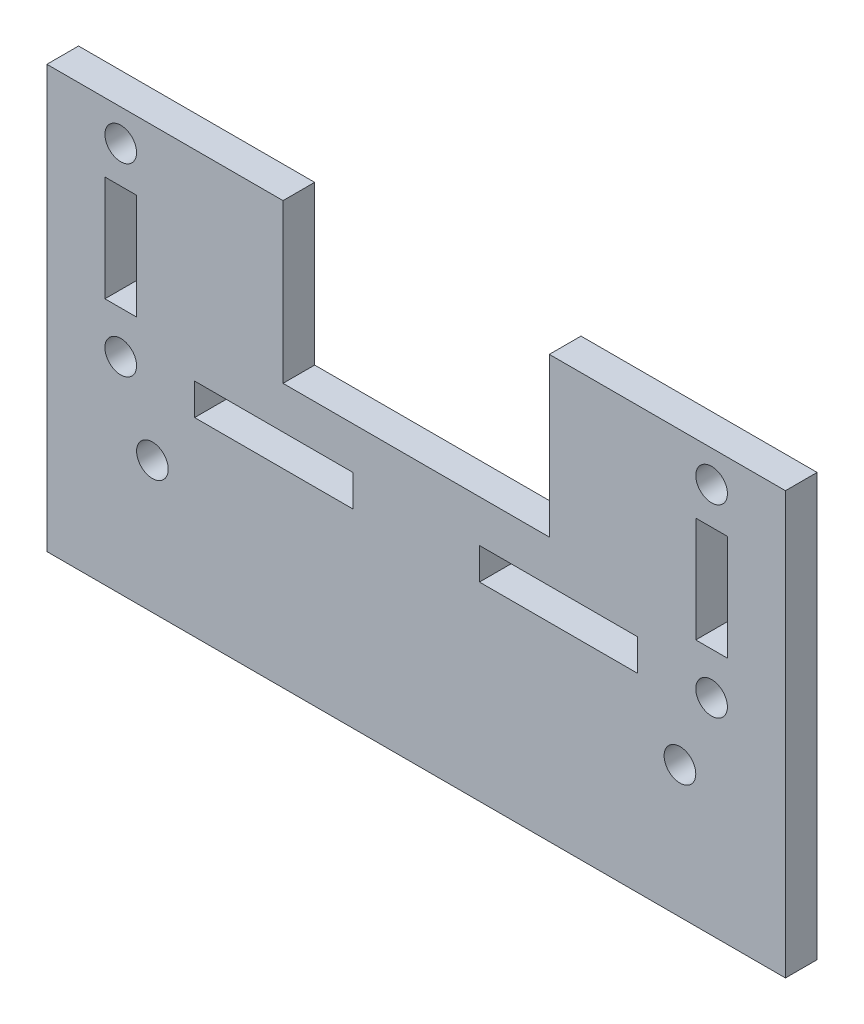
ISO-10303-21;
HEADER;
FILE_DESCRIPTION(('STEP AP214'),'2;1');
FILE_NAME('part.step','',(''),(''),'','','');
FILE_SCHEMA(('AUTOMOTIVE_DESIGN { 1 0 10303 214 1 1 1 1 }'));
ENDSEC;
DATA;
#1=APPLICATION_CONTEXT('core data for automotive mechanical design processes');
#2=APPLICATION_PROTOCOL_DEFINITION('international standard','automotive_design',2000,#1);
#3=PRODUCT_CONTEXT('',#1,'mechanical');
#4=PRODUCT('Part','Part','',(#3));
#5=PRODUCT_RELATED_PRODUCT_CATEGORY('part','',(#4));
#6=PRODUCT_DEFINITION_FORMATION('','',#4);
#7=PRODUCT_DEFINITION_CONTEXT('part definition',#1,'design');
#8=PRODUCT_DEFINITION('design','',#6,#7);
#9=PRODUCT_DEFINITION_SHAPE('','',#8);
#10=(LENGTH_UNIT() NAMED_UNIT(*) SI_UNIT(.MILLI.,.METRE.));
#11=(NAMED_UNIT(*) PLANE_ANGLE_UNIT() SI_UNIT($,.RADIAN.));
#12=(NAMED_UNIT(*) SI_UNIT($,.STERADIAN.) SOLID_ANGLE_UNIT());
#13=UNCERTAINTY_MEASURE_WITH_UNIT(LENGTH_MEASURE(1.E-05),#10,'distance_accuracy_value','');
#14=(GEOMETRIC_REPRESENTATION_CONTEXT(3) GLOBAL_UNCERTAINTY_ASSIGNED_CONTEXT((#13)) GLOBAL_UNIT_ASSIGNED_CONTEXT((#10,
#11,#12)) REPRESENTATION_CONTEXT('',''));
#15=CARTESIAN_POINT('',(0.,0.,0.));
#16=DIRECTION('',(0.,0.,1.));
#17=DIRECTION('',(1.,0.,0.));
#18=AXIS2_PLACEMENT_3D('',#15,#16,#17);
#19=CARTESIAN_POINT('',(0.,0.,3.));
#20=DIRECTION('',(0.,0.,1.));
#21=DIRECTION('',(1.,0.,0.));
#22=AXIS2_PLACEMENT_3D('',#19,#20,#21);
#23=PLANE('',#22);
#24=DIRECTION('',(0.,1.,0.));
#25=VECTOR('',#24,1.);
#26=CARTESIAN_POINT('',(-26.5,-1.83880688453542E-13,3.));
#27=LINE('',#26,#25);
#28=CARTESIAN_POINT('',(-26.5000000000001,11.0000000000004,3.));
#29=VERTEX_POINT('',#28);
#30=CARTESIAN_POINT('',(-26.5000000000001,21.0000000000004,3.));
#31=VERTEX_POINT('',#30);
#32=EDGE_CURVE('E279',#29,#31,#27,.T.);
#33=ORIENTED_EDGE('',*,*,#32,.F.);
#34=DIRECTION('',(-1.,0.,0.));
#35=VECTOR('',#34,1.);
#36=CARTESIAN_POINT('',(0.,11.0000000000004,3.));
#37=LINE('',#36,#35);
#38=CARTESIAN_POINT('',(-29.5000000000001,11.0000000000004,3.));
#39=VERTEX_POINT('',#38);
#40=EDGE_CURVE('E276',#29,#39,#37,.T.);
#41=ORIENTED_EDGE('',*,*,#40,.T.);
#42=DIRECTION('',(0.,1.,0.));
#43=VECTOR('',#42,1.);
#44=CARTESIAN_POINT('',(-29.5,-2.04697370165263E-13,3.));
#45=LINE('',#44,#43);
#46=CARTESIAN_POINT('',(-29.5000000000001,21.0000000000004,3.));
#47=VERTEX_POINT('',#46);
#48=EDGE_CURVE('E285',#39,#47,#45,.T.);
#49=ORIENTED_EDGE('',*,*,#48,.T.);
#50=DIRECTION('',(-1.,0.,0.));
#51=VECTOR('',#50,1.);
#52=CARTESIAN_POINT('',(0.,21.0000000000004,3.));
#53=LINE('',#52,#51);
#54=EDGE_CURVE('E282',#31,#47,#53,.T.);
#55=ORIENTED_EDGE('',*,*,#54,.F.);
#56=EDGE_LOOP('',(#33,#41,#49,#55));
#57=FACE_BOUND('',#56,.T.);
#58=CARTESIAN_POINT('',(-25.,0.,3.));
#59=DIRECTION('',(0.,0.,1.));
#60=DIRECTION('',(1.,0.,0.));
#61=AXIS2_PLACEMENT_3D('',#58,#59,#60);
#62=CIRCLE('',#61,1.5);
#63=CARTESIAN_POINT('',(-23.5,0.,3.));
#64=VERTEX_POINT('',#63);
#65=EDGE_CURVE('E323',#64,#64,#62,.T.);
#66=ORIENTED_EDGE('',*,*,#65,.F.);
#67=EDGE_LOOP('',(#66));
#68=FACE_BOUND('',#67,.T.);
#69=CARTESIAN_POINT('',(25.,0.,3.));
#70=DIRECTION('',(0.,0.,1.));
#71=DIRECTION('',(1.,0.,0.));
#72=AXIS2_PLACEMENT_3D('',#69,#70,#71);
#73=CIRCLE('',#72,1.5);
#74=CARTESIAN_POINT('',(26.5,0.,3.));
#75=VERTEX_POINT('',#74);
#76=EDGE_CURVE('E320',#75,#75,#73,.T.);
#77=ORIENTED_EDGE('',*,*,#76,.F.);
#78=EDGE_LOOP('',(#77));
#79=FACE_BOUND('',#78,.T.);
#80=DIRECTION('',(0.,1.,0.));
#81=VECTOR('',#80,1.);
#82=CARTESIAN_POINT('',(-35.,0.,3.));
#83=LINE('',#82,#81);
#84=CARTESIAN_POINT('',(-35.,-12.5,3.));
#85=VERTEX_POINT('',#84);
#86=CARTESIAN_POINT('',(-35.,27.5,3.));
#87=VERTEX_POINT('',#86);
#88=EDGE_CURVE('E298',#85,#87,#83,.T.);
#89=ORIENTED_EDGE('',*,*,#88,.F.);
#90=DIRECTION('',(1.,0.,0.));
#91=VECTOR('',#90,1.);
#92=CARTESIAN_POINT('',(0.,-12.5,3.));
#93=LINE('',#92,#91);
#94=CARTESIAN_POINT('',(35.,-12.5,3.));
#95=VERTEX_POINT('',#94);
#96=EDGE_CURVE('E301',#85,#95,#93,.T.);
#97=ORIENTED_EDGE('',*,*,#96,.T.);
#98=DIRECTION('',(0.,1.,0.));
#99=VECTOR('',#98,1.);
#100=CARTESIAN_POINT('',(35.,0.,3.));
#101=LINE('',#100,#99);
#102=CARTESIAN_POINT('',(35.,27.5,3.));
#103=VERTEX_POINT('',#102);
#104=EDGE_CURVE('E304',#95,#103,#101,.T.);
#105=ORIENTED_EDGE('',*,*,#104,.T.);
#106=DIRECTION('',(1.,0.,0.));
#107=VECTOR('',#106,1.);
#108=CARTESIAN_POINT('',(0.,27.5,3.));
#109=LINE('',#108,#107);
#110=CARTESIAN_POINT('',(12.6203854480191,27.5,3.));
#111=VERTEX_POINT('',#110);
#112=EDGE_CURVE('E306',#111,#103,#109,.T.);
#113=ORIENTED_EDGE('',*,*,#112,.F.);
#114=DIRECTION('',(0.,1.,0.));
#115=VECTOR('',#114,1.);
#116=CARTESIAN_POINT('',(12.6203854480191,0.,3.));
#117=LINE('',#116,#115);
#118=CARTESIAN_POINT('',(12.6203854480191,12.5,3.));
#119=VERTEX_POINT('',#118);
#120=EDGE_CURVE('E309',#119,#111,#117,.T.);
#121=ORIENTED_EDGE('',*,*,#120,.F.);
#122=DIRECTION('',(1.,0.,0.));
#123=VECTOR('',#122,1.);
#124=CARTESIAN_POINT('',(0.,12.5,3.));
#125=LINE('',#124,#123);
#126=CARTESIAN_POINT('',(-12.6203854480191,12.5,3.));
#127=VERTEX_POINT('',#126);
#128=EDGE_CURVE('E312',#127,#119,#125,.T.);
#129=ORIENTED_EDGE('',*,*,#128,.F.);
#130=DIRECTION('',(0.,1.,0.));
#131=VECTOR('',#130,1.);
#132=CARTESIAN_POINT('',(-12.6203854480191,0.,3.));
#133=LINE('',#132,#131);
#134=CARTESIAN_POINT('',(-12.6203854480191,27.5,3.));
#135=VERTEX_POINT('',#134);
#136=EDGE_CURVE('E315',#127,#135,#133,.T.);
#137=ORIENTED_EDGE('',*,*,#136,.T.);
#138=DIRECTION('',(1.,0.,0.));
#139=VECTOR('',#138,1.);
#140=CARTESIAN_POINT('',(0.,27.5,3.));
#141=LINE('',#140,#139);
#142=EDGE_CURVE('E317',#87,#135,#141,.T.);
#143=ORIENTED_EDGE('',*,*,#142,.F.);
#144=EDGE_LOOP('',(#89,#97,#105,#113,#121,#129,#137,#143));
#145=FACE_BOUND('',#144,.T.);
#146=DIRECTION('',(1.,0.,0.));
#147=VECTOR('',#146,1.);
#148=CARTESIAN_POINT('',(0.,5.50000000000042,3.));
#149=LINE('',#148,#147);
#150=CARTESIAN_POINT('',(6.,5.50000000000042,3.));
#151=VERTEX_POINT('',#150);
#152=CARTESIAN_POINT('',(21.,5.50000000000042,3.));
#153=VERTEX_POINT('',#152);
#154=EDGE_CURVE('E209',#151,#153,#149,.T.);
#155=ORIENTED_EDGE('',*,*,#154,.F.);
#156=DIRECTION('',(0.,1.,0.));
#157=VECTOR('',#156,1.);
#158=CARTESIAN_POINT('',(6.,0.,3.));
#159=LINE('',#158,#157);
#160=CARTESIAN_POINT('',(6.,8.50000000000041,3.));
#161=VERTEX_POINT('',#160);
#162=EDGE_CURVE('E243',#151,#161,#159,.T.);
#163=ORIENTED_EDGE('',*,*,#162,.T.);
#164=DIRECTION('',(1.,0.,0.));
#165=VECTOR('',#164,1.);
#166=CARTESIAN_POINT('',(0.,8.50000000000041,3.));
#167=LINE('',#166,#165);
#168=CARTESIAN_POINT('',(21.,8.50000000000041,3.));
#169=VERTEX_POINT('',#168);
#170=EDGE_CURVE('E252',#161,#169,#167,.T.);
#171=ORIENTED_EDGE('',*,*,#170,.T.);
#172=DIRECTION('',(0.,1.,0.));
#173=VECTOR('',#172,1.);
#174=CARTESIAN_POINT('',(21.,0.,3.));
#175=LINE('',#174,#173);
#176=EDGE_CURVE('E255',#153,#169,#175,.T.);
#177=ORIENTED_EDGE('',*,*,#176,.F.);
#178=EDGE_LOOP('',(#155,#163,#171,#177));
#179=FACE_BOUND('',#178,.T.);
#180=DIRECTION('',(1.,0.,0.));
#181=VECTOR('',#180,1.);
#182=CARTESIAN_POINT('',(0.,11.0000000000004,3.));
#183=LINE('',#182,#181);
#184=CARTESIAN_POINT('',(26.5,11.0000000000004,3.));
#185=VERTEX_POINT('',#184);
#186=CARTESIAN_POINT('',(29.5,11.0000000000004,3.));
#187=VERTEX_POINT('',#186);
#188=EDGE_CURVE('E65',#185,#187,#183,.T.);
#189=ORIENTED_EDGE('',*,*,#188,.F.);
#190=DIRECTION('',(0.,1.,0.));
#191=VECTOR('',#190,1.);
#192=CARTESIAN_POINT('',(26.5,0.,3.));
#193=LINE('',#192,#191);
#194=CARTESIAN_POINT('',(26.5,21.0000000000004,3.));
#195=VERTEX_POINT('',#194);
#196=EDGE_CURVE('E261',#185,#195,#193,.T.);
#197=ORIENTED_EDGE('',*,*,#196,.T.);
#198=DIRECTION('',(1.,0.,0.));
#199=VECTOR('',#198,1.);
#200=CARTESIAN_POINT('',(0.,21.0000000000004,3.));
#201=LINE('',#200,#199);
#202=CARTESIAN_POINT('',(29.5,21.0000000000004,3.));
#203=VERTEX_POINT('',#202);
#204=EDGE_CURVE('E269',#195,#203,#201,.T.);
#205=ORIENTED_EDGE('',*,*,#204,.T.);
#206=DIRECTION('',(0.,1.,0.));
#207=VECTOR('',#206,1.);
#208=CARTESIAN_POINT('',(29.5,0.,3.));
#209=LINE('',#208,#207);
#210=EDGE_CURVE('E272',#187,#203,#209,.T.);
#211=ORIENTED_EDGE('',*,*,#210,.F.);
#212=EDGE_LOOP('',(#189,#197,#205,#211));
#213=FACE_BOUND('',#212,.T.);
#214=CARTESIAN_POINT('',(28.,24.5000000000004,3.));
#215=DIRECTION('',(0.,0.,1.));
#216=DIRECTION('',(1.,0.,0.));
#217=AXIS2_PLACEMENT_3D('',#214,#215,#216);
#218=CIRCLE('',#217,1.5);
#219=CARTESIAN_POINT('',(29.5,24.5000000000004,3.));
#220=VERTEX_POINT('',#219);
#221=EDGE_CURVE('E233',#220,#220,#218,.T.);
#222=ORIENTED_EDGE('',*,*,#221,.F.);
#223=EDGE_LOOP('',(#222));
#224=FACE_BOUND('',#223,.T.);
#225=CARTESIAN_POINT('',(28.,7.00000000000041,3.));
#226=DIRECTION('',(0.,0.,1.));
#227=DIRECTION('',(1.,0.,0.));
#228=AXIS2_PLACEMENT_3D('',#225,#226,#227);
#229=CIRCLE('',#228,1.5);
#230=CARTESIAN_POINT('',(29.5,7.00000000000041,3.));
#231=VERTEX_POINT('',#230);
#232=EDGE_CURVE('E237',#231,#231,#229,.T.);
#233=ORIENTED_EDGE('',*,*,#232,.F.);
#234=EDGE_LOOP('',(#233));
#235=FACE_BOUND('',#234,.T.);
#236=DIRECTION('',(1.,0.,0.));
#237=VECTOR('',#236,1.);
#238=CARTESIAN_POINT('',(0.,5.50000000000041,3.));
#239=LINE('',#238,#237);
#240=CARTESIAN_POINT('',(-21.,5.50000000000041,3.));
#241=VERTEX_POINT('',#240);
#242=CARTESIAN_POINT('',(-6.,5.50000000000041,3.));
#243=VERTEX_POINT('',#242);
#244=EDGE_CURVE('E57',#241,#243,#239,.T.);
#245=ORIENTED_EDGE('',*,*,#244,.F.);
#246=DIRECTION('',(0.,1.,0.));
#247=VECTOR('',#246,1.);
#248=CARTESIAN_POINT('',(-21.,0.,3.));
#249=LINE('',#248,#247);
#250=CARTESIAN_POINT('',(-21.,8.50000000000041,3.));
#251=VERTEX_POINT('',#250);
#252=EDGE_CURVE('E212',#241,#251,#249,.T.);
#253=ORIENTED_EDGE('',*,*,#252,.T.);
#254=DIRECTION('',(1.,0.,0.));
#255=VECTOR('',#254,1.);
#256=CARTESIAN_POINT('',(0.,8.50000000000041,3.));
#257=LINE('',#256,#255);
#258=CARTESIAN_POINT('',(-6.,8.50000000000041,3.));
#259=VERTEX_POINT('',#258);
#260=EDGE_CURVE('E218',#251,#259,#257,.T.);
#261=ORIENTED_EDGE('',*,*,#260,.T.);
#262=DIRECTION('',(0.,1.,0.));
#263=VECTOR('',#262,1.);
#264=CARTESIAN_POINT('',(-6.,0.,3.));
#265=LINE('',#264,#263);
#266=EDGE_CURVE('E224',#243,#259,#265,.T.);
#267=ORIENTED_EDGE('',*,*,#266,.F.);
#268=EDGE_LOOP('',(#245,#253,#261,#267));
#269=FACE_BOUND('',#268,.T.);
#270=CARTESIAN_POINT('',(-28.,7.00000000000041,3.));
#271=DIRECTION('',(0.,0.,1.));
#272=DIRECTION('',(1.,0.,0.));
#273=AXIS2_PLACEMENT_3D('',#270,#271,#272);
#274=CIRCLE('',#273,1.5);
#275=CARTESIAN_POINT('',(-26.5,7.00000000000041,3.));
#276=VERTEX_POINT('',#275);
#277=EDGE_CURVE('E225',#276,#276,#274,.T.);
#278=ORIENTED_EDGE('',*,*,#277,.F.);
#279=EDGE_LOOP('',(#278));
#280=FACE_BOUND('',#279,.T.);
#281=CARTESIAN_POINT('',(-28.0000000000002,24.5000000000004,3.));
#282=DIRECTION('',(0.,0.,1.));
#283=DIRECTION('',(1.,0.,0.));
#284=AXIS2_PLACEMENT_3D('',#281,#282,#283);
#285=CIRCLE('',#284,1.5);
#286=CARTESIAN_POINT('',(-26.5000000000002,24.5000000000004,3.));
#287=VERTEX_POINT('',#286);
#288=EDGE_CURVE('E228',#287,#287,#285,.F.);
#289=ORIENTED_EDGE('',*,*,#288,.T.);
#290=EDGE_LOOP('',(#289));
#291=FACE_BOUND('',#290,.T.);
#292=ADVANCED_FACE('F40',(#57,#68,#79,#145,#179,#213,#224,#235,#269,#280,#291),#23,.T.);
#293=CARTESIAN_POINT('',(0.,0.,0.));
#294=DIRECTION('',(0.,0.,1.));
#295=DIRECTION('',(1.,0.,0.));
#296=AXIS2_PLACEMENT_3D('',#293,#294,#295);
#297=PLANE('',#296);
#298=CARTESIAN_POINT('',(-28.,7.00000000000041,0.));
#299=DIRECTION('',(0.,0.,1.));
#300=DIRECTION('',(1.,0.,0.));
#301=AXIS2_PLACEMENT_3D('',#298,#299,#300);
#302=CIRCLE('',#301,1.5);
#303=CARTESIAN_POINT('',(-26.5,7.00000000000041,0.));
#304=VERTEX_POINT('',#303);
#305=EDGE_CURVE('E409',#304,#304,#302,.T.);
#306=ORIENTED_EDGE('',*,*,#305,.T.);
#307=EDGE_LOOP('',(#306));
#308=FACE_BOUND('',#307,.T.);
#309=DIRECTION('',(0.,1.,0.));
#310=VECTOR('',#309,1.);
#311=CARTESIAN_POINT('',(-21.,0.,0.));
#312=LINE('',#311,#310);
#313=CARTESIAN_POINT('',(-21.,5.50000000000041,0.));
#314=VERTEX_POINT('',#313);
#315=CARTESIAN_POINT('',(-21.,8.50000000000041,0.));
#316=VERTEX_POINT('',#315);
#317=EDGE_CURVE('E49',#314,#316,#312,.T.);
#318=ORIENTED_EDGE('',*,*,#317,.F.);
#319=DIRECTION('',(1.,0.,0.));
#320=VECTOR('',#319,1.);
#321=CARTESIAN_POINT('',(0.,5.50000000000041,0.));
#322=LINE('',#321,#320);
#323=CARTESIAN_POINT('',(-6.,5.50000000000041,0.));
#324=VERTEX_POINT('',#323);
#325=EDGE_CURVE('E12',#314,#324,#322,.T.);
#326=ORIENTED_EDGE('',*,*,#325,.T.);
#327=DIRECTION('',(0.,1.,0.));
#328=VECTOR('',#327,1.);
#329=CARTESIAN_POINT('',(-6.,0.,0.));
#330=LINE('',#329,#328);
#331=CARTESIAN_POINT('',(-6.,8.50000000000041,0.));
#332=VERTEX_POINT('',#331);
#333=EDGE_CURVE('E402',#324,#332,#330,.T.);
#334=ORIENTED_EDGE('',*,*,#333,.T.);
#335=DIRECTION('',(1.,0.,0.));
#336=VECTOR('',#335,1.);
#337=CARTESIAN_POINT('',(0.,8.50000000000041,0.));
#338=LINE('',#337,#336);
#339=EDGE_CURVE('E412',#316,#332,#338,.T.);
#340=ORIENTED_EDGE('',*,*,#339,.F.);
#341=EDGE_LOOP('',(#318,#326,#334,#340));
#342=FACE_BOUND('',#341,.T.);
#343=CARTESIAN_POINT('',(28.,7.00000000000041,0.));
#344=DIRECTION('',(0.,0.,1.));
#345=DIRECTION('',(1.,0.,0.));
#346=AXIS2_PLACEMENT_3D('',#343,#344,#345);
#347=CIRCLE('',#346,1.5);
#348=CARTESIAN_POINT('',(29.5,7.00000000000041,0.));
#349=VERTEX_POINT('',#348);
#350=EDGE_CURVE('E406',#349,#349,#347,.T.);
#351=ORIENTED_EDGE('',*,*,#350,.T.);
#352=EDGE_LOOP('',(#351));
#353=FACE_BOUND('',#352,.T.);
#354=CARTESIAN_POINT('',(28.,24.5000000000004,0.));
#355=DIRECTION('',(0.,0.,1.));
#356=DIRECTION('',(1.,0.,0.));
#357=AXIS2_PLACEMENT_3D('',#354,#355,#356);
#358=CIRCLE('',#357,1.5);
#359=CARTESIAN_POINT('',(29.5,24.5000000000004,0.));
#360=VERTEX_POINT('',#359);
#361=EDGE_CURVE('E403',#360,#360,#358,.T.);
#362=ORIENTED_EDGE('',*,*,#361,.T.);
#363=EDGE_LOOP('',(#362));
#364=FACE_BOUND('',#363,.T.);
#365=DIRECTION('',(0.,1.,0.));
#366=VECTOR('',#365,1.);
#367=CARTESIAN_POINT('',(26.5,0.,0.));
#368=LINE('',#367,#366);
#369=CARTESIAN_POINT('',(26.5,11.0000000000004,0.));
#370=VERTEX_POINT('',#369);
#371=CARTESIAN_POINT('',(26.5,21.0000000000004,0.));
#372=VERTEX_POINT('',#371);
#373=EDGE_CURVE('E397',#370,#372,#368,.T.);
#374=ORIENTED_EDGE('',*,*,#373,.F.);
#375=DIRECTION('',(1.,0.,0.));
#376=VECTOR('',#375,1.);
#377=CARTESIAN_POINT('',(0.,11.0000000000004,0.));
#378=LINE('',#377,#376);
#379=CARTESIAN_POINT('',(29.5,11.0000000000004,0.));
#380=VERTEX_POINT('',#379);
#381=EDGE_CURVE('E399',#370,#380,#378,.T.);
#382=ORIENTED_EDGE('',*,*,#381,.T.);
#383=DIRECTION('',(0.,1.,0.));
#384=VECTOR('',#383,1.);
#385=CARTESIAN_POINT('',(29.5,0.,0.));
#386=LINE('',#385,#384);
#387=CARTESIAN_POINT('',(29.5,21.0000000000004,0.));
#388=VERTEX_POINT('',#387);
#389=EDGE_CURVE('E391',#380,#388,#386,.T.);
#390=ORIENTED_EDGE('',*,*,#389,.T.);
#391=DIRECTION('',(1.,0.,0.));
#392=VECTOR('',#391,1.);
#393=CARTESIAN_POINT('',(0.,21.0000000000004,0.));
#394=LINE('',#393,#392);
#395=EDGE_CURVE('E394',#372,#388,#394,.T.);
#396=ORIENTED_EDGE('',*,*,#395,.F.);
#397=EDGE_LOOP('',(#374,#382,#390,#396));
#398=FACE_BOUND('',#397,.T.);
#399=DIRECTION('',(0.,1.,0.));
#400=VECTOR('',#399,1.);
#401=CARTESIAN_POINT('',(6.,0.,0.));
#402=LINE('',#401,#400);
#403=CARTESIAN_POINT('',(6.,5.50000000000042,0.));
#404=VERTEX_POINT('',#403);
#405=CARTESIAN_POINT('',(6.,8.50000000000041,0.));
#406=VERTEX_POINT('',#405);
#407=EDGE_CURVE('E386',#404,#406,#402,.T.);
#408=ORIENTED_EDGE('',*,*,#407,.F.);
#409=DIRECTION('',(1.,0.,0.));
#410=VECTOR('',#409,1.);
#411=CARTESIAN_POINT('',(0.,5.50000000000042,0.));
#412=LINE('',#411,#410);
#413=CARTESIAN_POINT('',(21.,5.50000000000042,0.));
#414=VERTEX_POINT('',#413);
#415=EDGE_CURVE('E388',#404,#414,#412,.T.);
#416=ORIENTED_EDGE('',*,*,#415,.T.);
#417=DIRECTION('',(0.,1.,0.));
#418=VECTOR('',#417,1.);
#419=CARTESIAN_POINT('',(21.,0.,0.));
#420=LINE('',#419,#418);
#421=CARTESIAN_POINT('',(21.,8.50000000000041,0.));
#422=VERTEX_POINT('',#421);
#423=EDGE_CURVE('E380',#414,#422,#420,.T.);
#424=ORIENTED_EDGE('',*,*,#423,.T.);
#425=DIRECTION('',(1.,0.,0.));
#426=VECTOR('',#425,1.);
#427=CARTESIAN_POINT('',(0.,8.50000000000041,0.));
#428=LINE('',#427,#426);
#429=EDGE_CURVE('E383',#406,#422,#428,.T.);
#430=ORIENTED_EDGE('',*,*,#429,.F.);
#431=EDGE_LOOP('',(#408,#416,#424,#430));
#432=FACE_BOUND('',#431,.T.);
#433=CARTESIAN_POINT('',(-25.,0.,0.));
#434=DIRECTION('',(0.,0.,1.));
#435=DIRECTION('',(1.,0.,0.));
#436=AXIS2_PLACEMENT_3D('',#433,#434,#435);
#437=CIRCLE('',#436,1.5);
#438=CARTESIAN_POINT('',(-23.5,0.,0.));
#439=VERTEX_POINT('',#438);
#440=EDGE_CURVE('E302',#439,#439,#437,.T.);
#441=ORIENTED_EDGE('',*,*,#440,.T.);
#442=EDGE_LOOP('',(#441));
#443=FACE_BOUND('',#442,.T.);
#444=CARTESIAN_POINT('',(25.,0.,0.));
#445=DIRECTION('',(0.,0.,1.));
#446=DIRECTION('',(1.,0.,0.));
#447=AXIS2_PLACEMENT_3D('',#444,#445,#446);
#448=CIRCLE('',#447,1.5);
#449=CARTESIAN_POINT('',(26.5,0.,0.));
#450=VERTEX_POINT('',#449);
#451=EDGE_CURVE('E349',#450,#450,#448,.T.);
#452=ORIENTED_EDGE('',*,*,#451,.T.);
#453=EDGE_LOOP('',(#452));
#454=FACE_BOUND('',#453,.T.);
#455=DIRECTION('',(0.,1.,0.));
#456=VECTOR('',#455,1.);
#457=CARTESIAN_POINT('',(-35.,0.,0.));
#458=LINE('',#457,#456);
#459=CARTESIAN_POINT('',(-35.,-12.5,0.));
#460=VERTEX_POINT('',#459);
#461=CARTESIAN_POINT('',(-35.,27.5,0.));
#462=VERTEX_POINT('',#461);
#463=EDGE_CURVE('E291',#460,#462,#458,.T.);
#464=ORIENTED_EDGE('',*,*,#463,.T.);
#465=DIRECTION('',(1.,0.,0.));
#466=VECTOR('',#465,1.);
#467=CARTESIAN_POINT('',(0.,27.5,0.));
#468=LINE('',#467,#466);
#469=CARTESIAN_POINT('',(-12.6203854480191,27.5,0.));
#470=VERTEX_POINT('',#469);
#471=EDGE_CURVE('E346',#462,#470,#468,.T.);
#472=ORIENTED_EDGE('',*,*,#471,.T.);
#473=DIRECTION('',(0.,1.,0.));
#474=VECTOR('',#473,1.);
#475=CARTESIAN_POINT('',(-12.6203854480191,0.,0.));
#476=LINE('',#475,#474);
#477=CARTESIAN_POINT('',(-12.6203854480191,12.5,0.));
#478=VERTEX_POINT('',#477);
#479=EDGE_CURVE('E343',#478,#470,#476,.T.);
#480=ORIENTED_EDGE('',*,*,#479,.F.);
#481=DIRECTION('',(1.,0.,0.));
#482=VECTOR('',#481,1.);
#483=CARTESIAN_POINT('',(0.,12.5,0.));
#484=LINE('',#483,#482);
#485=CARTESIAN_POINT('',(12.6203854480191,12.5,0.));
#486=VERTEX_POINT('',#485);
#487=EDGE_CURVE('E340',#478,#486,#484,.T.);
#488=ORIENTED_EDGE('',*,*,#487,.T.);
#489=DIRECTION('',(0.,1.,0.));
#490=VECTOR('',#489,1.);
#491=CARTESIAN_POINT('',(12.6203854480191,0.,0.));
#492=LINE('',#491,#490);
#493=CARTESIAN_POINT('',(12.6203854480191,27.5,0.));
#494=VERTEX_POINT('',#493);
#495=EDGE_CURVE('E337',#486,#494,#492,.T.);
#496=ORIENTED_EDGE('',*,*,#495,.T.);
#497=DIRECTION('',(1.,0.,0.));
#498=VECTOR('',#497,1.);
#499=CARTESIAN_POINT('',(0.,27.5,0.));
#500=LINE('',#499,#498);
#501=CARTESIAN_POINT('',(35.,27.5,0.));
#502=VERTEX_POINT('',#501);
#503=EDGE_CURVE('E334',#494,#502,#500,.T.);
#504=ORIENTED_EDGE('',*,*,#503,.T.);
#505=DIRECTION('',(0.,1.,0.));
#506=VECTOR('',#505,1.);
#507=CARTESIAN_POINT('',(35.,0.,0.));
#508=LINE('',#507,#506);
#509=CARTESIAN_POINT('',(35.,-12.5,0.));
#510=VERTEX_POINT('',#509);
#511=EDGE_CURVE('E331',#510,#502,#508,.T.);
#512=ORIENTED_EDGE('',*,*,#511,.F.);
#513=DIRECTION('',(1.,0.,0.));
#514=VECTOR('',#513,1.);
#515=CARTESIAN_POINT('',(0.,-12.5,0.));
#516=LINE('',#515,#514);
#517=EDGE_CURVE('E329',#460,#510,#516,.T.);
#518=ORIENTED_EDGE('',*,*,#517,.F.);
#519=EDGE_LOOP('',(#464,#472,#480,#488,#496,#504,#512,#518));
#520=FACE_BOUND('',#519,.T.);
#521=DIRECTION('',(-1.,0.,0.));
#522=VECTOR('',#521,1.);
#523=CARTESIAN_POINT('',(0.,11.0000000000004,0.));
#524=LINE('',#523,#522);
#525=CARTESIAN_POINT('',(-26.5000000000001,11.0000000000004,0.));
#526=VERTEX_POINT('',#525);
#527=CARTESIAN_POINT('',(-29.5000000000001,11.0000000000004,0.));
#528=VERTEX_POINT('',#527);
#529=EDGE_CURVE('E378',#526,#528,#524,.T.);
#530=ORIENTED_EDGE('',*,*,#529,.F.);
#531=DIRECTION('',(0.,1.,0.));
#532=VECTOR('',#531,1.);
#533=CARTESIAN_POINT('',(-26.5,-1.83880688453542E-13,0.));
#534=LINE('',#533,#532);
#535=CARTESIAN_POINT('',(-26.5000000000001,21.0000000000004,0.));
#536=VERTEX_POINT('',#535);
#537=EDGE_CURVE('E370',#526,#536,#534,.T.);
#538=ORIENTED_EDGE('',*,*,#537,.T.);
#539=DIRECTION('',(-1.,0.,0.));
#540=VECTOR('',#539,1.);
#541=CARTESIAN_POINT('',(0.,21.0000000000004,0.));
#542=LINE('',#541,#540);
#543=CARTESIAN_POINT('',(-29.5000000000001,21.0000000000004,0.));
#544=VERTEX_POINT('',#543);
#545=EDGE_CURVE('E373',#536,#544,#542,.T.);
#546=ORIENTED_EDGE('',*,*,#545,.T.);
#547=DIRECTION('',(0.,1.,0.));
#548=VECTOR('',#547,1.);
#549=CARTESIAN_POINT('',(-29.5,-2.04697370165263E-13,0.));
#550=LINE('',#549,#548);
#551=EDGE_CURVE('E376',#528,#544,#550,.T.);
#552=ORIENTED_EDGE('',*,*,#551,.F.);
#553=EDGE_LOOP('',(#530,#538,#546,#552));
#554=FACE_BOUND('',#553,.T.);
#555=CARTESIAN_POINT('',(-28.0000000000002,24.5000000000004,0.));
#556=DIRECTION('',(0.,0.,1.));
#557=DIRECTION('',(1.,0.,0.));
#558=AXIS2_PLACEMENT_3D('',#555,#556,#557);
#559=CIRCLE('',#558,1.5);
#560=CARTESIAN_POINT('',(-26.5000000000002,24.5000000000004,0.));
#561=VERTEX_POINT('',#560);
#562=EDGE_CURVE('E44',#561,#561,#559,.F.);
#563=ORIENTED_EDGE('',*,*,#562,.F.);
#564=EDGE_LOOP('',(#563));
#565=FACE_BOUND('',#564,.T.);
#566=ADVANCED_FACE('F423',(#308,#342,#353,#364,#398,#432,#443,#454,#520,#554,#565),#297,.F.);
#567=CARTESIAN_POINT('',(-35.,0.,3.));
#568=DIRECTION('',(-1.,0.,0.));
#569=DIRECTION('',(0.,0.,1.));
#570=AXIS2_PLACEMENT_3D('',#567,#568,#569);
#571=PLANE('',#570);
#572=ORIENTED_EDGE('',*,*,#463,.F.);
#573=DIRECTION('',(0.,0.,-1.));
#574=VECTOR('',#573,1.);
#575=CARTESIAN_POINT('',(-35.,-12.5,3.));
#576=LINE('',#575,#574);
#577=EDGE_CURVE('E368',#85,#460,#576,.T.);
#578=ORIENTED_EDGE('',*,*,#577,.F.);
#579=ORIENTED_EDGE('',*,*,#88,.T.);
#580=DIRECTION('',(0.,0.,-1.));
#581=VECTOR('',#580,1.);
#582=CARTESIAN_POINT('',(-35.,27.5,3.));
#583=LINE('',#582,#581);
#584=EDGE_CURVE('E326',#87,#462,#583,.T.);
#585=ORIENTED_EDGE('',*,*,#584,.T.);
#586=EDGE_LOOP('',(#572,#578,#579,#585));
#587=FACE_BOUND('',#586,.T.);
#588=ADVANCED_FACE('F42',(#587),#571,.T.);
#589=CARTESIAN_POINT('',(0.,-12.5,3.));
#590=DIRECTION('',(0.,1.,0.));
#591=DIRECTION('',(0.,0.,1.));
#592=AXIS2_PLACEMENT_3D('',#589,#590,#591);
#593=PLANE('',#592);
#594=ORIENTED_EDGE('',*,*,#517,.T.);
#595=DIRECTION('',(0.,0.,-1.));
#596=VECTOR('',#595,1.);
#597=CARTESIAN_POINT('',(35.,-12.5,3.));
#598=LINE('',#597,#596);
#599=EDGE_CURVE('E365',#95,#510,#598,.T.);
#600=ORIENTED_EDGE('',*,*,#599,.F.);
#601=ORIENTED_EDGE('',*,*,#96,.F.);
#602=ORIENTED_EDGE('',*,*,#577,.T.);
#603=EDGE_LOOP('',(#594,#600,#601,#602));
#604=FACE_BOUND('',#603,.T.);
#605=ADVANCED_FACE('F430',(#604),#593,.F.);
#606=CARTESIAN_POINT('',(35.,0.,3.));
#607=DIRECTION('',(-1.,0.,0.));
#608=DIRECTION('',(0.,0.,1.));
#609=AXIS2_PLACEMENT_3D('',#606,#607,#608);
#610=PLANE('',#609);
#611=ORIENTED_EDGE('',*,*,#511,.T.);
#612=DIRECTION('',(0.,0.,-1.));
#613=VECTOR('',#612,1.);
#614=CARTESIAN_POINT('',(35.,27.5,3.));
#615=LINE('',#614,#613);
#616=EDGE_CURVE('E363',#103,#502,#615,.T.);
#617=ORIENTED_EDGE('',*,*,#616,.F.);
#618=ORIENTED_EDGE('',*,*,#104,.F.);
#619=ORIENTED_EDGE('',*,*,#599,.T.);
#620=EDGE_LOOP('',(#611,#617,#618,#619));
#621=FACE_BOUND('',#620,.T.);
#622=ADVANCED_FACE('F465',(#621),#610,.F.);
#623=CARTESIAN_POINT('',(0.,27.5,3.));
#624=DIRECTION('',(0.,1.,0.));
#625=DIRECTION('',(0.,0.,1.));
#626=AXIS2_PLACEMENT_3D('',#623,#624,#625);
#627=PLANE('',#626);
#628=ORIENTED_EDGE('',*,*,#503,.F.);
#629=DIRECTION('',(0.,0.,-1.));
#630=VECTOR('',#629,1.);
#631=CARTESIAN_POINT('',(12.6203854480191,27.5,3.));
#632=LINE('',#631,#630);
#633=EDGE_CURVE('E361',#111,#494,#632,.T.);
#634=ORIENTED_EDGE('',*,*,#633,.F.);
#635=ORIENTED_EDGE('',*,*,#112,.T.);
#636=ORIENTED_EDGE('',*,*,#616,.T.);
#637=EDGE_LOOP('',(#628,#634,#635,#636));
#638=FACE_BOUND('',#637,.T.);
#639=ADVANCED_FACE('F461',(#638),#627,.T.);
#640=CARTESIAN_POINT('',(12.6203854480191,0.,3.));
#641=DIRECTION('',(-1.,0.,0.));
#642=DIRECTION('',(0.,0.,1.));
#643=AXIS2_PLACEMENT_3D('',#640,#641,#642);
#644=PLANE('',#643);
#645=ORIENTED_EDGE('',*,*,#495,.F.);
#646=DIRECTION('',(0.,0.,-1.));
#647=VECTOR('',#646,1.);
#648=CARTESIAN_POINT('',(12.6203854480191,12.5,3.));
#649=LINE('',#648,#647);
#650=EDGE_CURVE('E359',#119,#486,#649,.T.);
#651=ORIENTED_EDGE('',*,*,#650,.F.);
#652=ORIENTED_EDGE('',*,*,#120,.T.);
#653=ORIENTED_EDGE('',*,*,#633,.T.);
#654=EDGE_LOOP('',(#645,#651,#652,#653));
#655=FACE_BOUND('',#654,.T.);
#656=ADVANCED_FACE('F457',(#655),#644,.T.);
#657=CARTESIAN_POINT('',(0.,12.5,3.));
#658=DIRECTION('',(0.,1.,0.));
#659=DIRECTION('',(0.,0.,1.));
#660=AXIS2_PLACEMENT_3D('',#657,#658,#659);
#661=PLANE('',#660);
#662=ORIENTED_EDGE('',*,*,#487,.F.);
#663=DIRECTION('',(0.,0.,-1.));
#664=VECTOR('',#663,1.);
#665=CARTESIAN_POINT('',(-12.6203854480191,12.5,3.));
#666=LINE('',#665,#664);
#667=EDGE_CURVE('E357',#127,#478,#666,.T.);
#668=ORIENTED_EDGE('',*,*,#667,.F.);
#669=ORIENTED_EDGE('',*,*,#128,.T.);
#670=ORIENTED_EDGE('',*,*,#650,.T.);
#671=EDGE_LOOP('',(#662,#668,#669,#670));
#672=FACE_BOUND('',#671,.T.);
#673=ADVANCED_FACE('F453',(#672),#661,.T.);
#674=CARTESIAN_POINT('',(-12.6203854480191,0.,3.));
#675=DIRECTION('',(-1.,0.,0.));
#676=DIRECTION('',(0.,0.,1.));
#677=AXIS2_PLACEMENT_3D('',#674,#675,#676);
#678=PLANE('',#677);
#679=ORIENTED_EDGE('',*,*,#479,.T.);
#680=DIRECTION('',(0.,0.,-1.));
#681=VECTOR('',#680,1.);
#682=CARTESIAN_POINT('',(-12.6203854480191,27.5,3.));
#683=LINE('',#682,#681);
#684=EDGE_CURVE('E355',#135,#470,#683,.T.);
#685=ORIENTED_EDGE('',*,*,#684,.F.);
#686=ORIENTED_EDGE('',*,*,#136,.F.);
#687=ORIENTED_EDGE('',*,*,#667,.T.);
#688=EDGE_LOOP('',(#679,#685,#686,#687));
#689=FACE_BOUND('',#688,.T.);
#690=ADVANCED_FACE('F446',(#689),#678,.F.);
#691=CARTESIAN_POINT('',(25.,0.,3.));
#692=DIRECTION('',(0.,0.,-1.));
#693=DIRECTION('',(-1.,0.,0.));
#694=AXIS2_PLACEMENT_3D('',#691,#692,#693);
#695=CYLINDRICAL_SURFACE('',#694,1.5);
#696=ORIENTED_EDGE('',*,*,#76,.T.);
#697=EDGE_LOOP('',(#696));
#698=FACE_BOUND('',#697,.T.);
#699=ORIENTED_EDGE('',*,*,#451,.F.);
#700=EDGE_LOOP('',(#699));
#701=FACE_BOUND('',#700,.T.);
#702=ADVANCED_FACE('F443',(#698,#701),#695,.F.);
#703=CARTESIAN_POINT('',(0.,27.5,3.));
#704=DIRECTION('',(0.,1.,0.));
#705=DIRECTION('',(0.,0.,1.));
#706=AXIS2_PLACEMENT_3D('',#703,#704,#705);
#707=PLANE('',#706);
#708=ORIENTED_EDGE('',*,*,#471,.F.);
#709=ORIENTED_EDGE('',*,*,#584,.F.);
#710=ORIENTED_EDGE('',*,*,#142,.T.);
#711=ORIENTED_EDGE('',*,*,#684,.T.);
#712=EDGE_LOOP('',(#708,#709,#710,#711));
#713=FACE_BOUND('',#712,.T.);
#714=ADVANCED_FACE('F441',(#713),#707,.T.);
#715=CARTESIAN_POINT('',(-25.,0.,3.));
#716=DIRECTION('',(0.,0.,-1.));
#717=DIRECTION('',(-1.,0.,0.));
#718=AXIS2_PLACEMENT_3D('',#715,#716,#717);
#719=CYLINDRICAL_SURFACE('',#718,1.5);
#720=ORIENTED_EDGE('',*,*,#65,.T.);
#721=EDGE_LOOP('',(#720));
#722=FACE_BOUND('',#721,.T.);
#723=ORIENTED_EDGE('',*,*,#440,.F.);
#724=EDGE_LOOP('',(#723));
#725=FACE_BOUND('',#724,.T.);
#726=ADVANCED_FACE('F437',(#722,#725),#719,.F.);
#727=CARTESIAN_POINT('',(0.,11.0000000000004,-7.));
#728=DIRECTION('',(0.,1.,0.));
#729=DIRECTION('',(0.,0.,1.));
#730=AXIS2_PLACEMENT_3D('',#727,#728,#729);
#731=PLANE('',#730);
#732=ORIENTED_EDGE('',*,*,#529,.T.);
#733=DIRECTION('',(0.,0.,1.));
#734=VECTOR('',#733,1.);
#735=CARTESIAN_POINT('',(-29.5000000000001,11.0000000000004,-7.));
#736=LINE('',#735,#734);
#737=EDGE_CURVE('E289',#528,#39,#736,.T.);
#738=ORIENTED_EDGE('',*,*,#737,.T.);
#739=ORIENTED_EDGE('',*,*,#40,.F.);
#740=DIRECTION('',(0.,0.,1.));
#741=VECTOR('',#740,1.);
#742=CARTESIAN_POINT('',(-26.5000000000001,11.0000000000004,-7.));
#743=LINE('',#742,#741);
#744=EDGE_CURVE('E288',#526,#29,#743,.T.);
#745=ORIENTED_EDGE('',*,*,#744,.F.);
#746=EDGE_LOOP('',(#732,#738,#739,#745));
#747=FACE_BOUND('',#746,.T.);
#748=ADVANCED_FACE('F440',(#747),#731,.T.);
#749=CARTESIAN_POINT('',(-29.5,-2.04697370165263E-13,-7.));
#750=DIRECTION('',(1.,0.,0.));
#751=DIRECTION('',(0.,1.,0.));
#752=AXIS2_PLACEMENT_3D('',#749,#750,#751);
#753=PLANE('',#752);
#754=ORIENTED_EDGE('',*,*,#551,.T.);
#755=DIRECTION('',(0.,0.,1.));
#756=VECTOR('',#755,1.);
#757=CARTESIAN_POINT('',(-29.5000000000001,21.0000000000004,-7.));
#758=LINE('',#757,#756);
#759=EDGE_CURVE('E292',#544,#47,#758,.T.);
#760=ORIENTED_EDGE('',*,*,#759,.T.);
#761=ORIENTED_EDGE('',*,*,#48,.F.);
#762=ORIENTED_EDGE('',*,*,#737,.F.);
#763=EDGE_LOOP('',(#754,#760,#761,#762));
#764=FACE_BOUND('',#763,.T.);
#765=ADVANCED_FACE('F571',(#764),#753,.T.);
#766=CARTESIAN_POINT('',(0.,21.0000000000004,-7.));
#767=DIRECTION('',(0.,1.,0.));
#768=DIRECTION('',(0.,0.,1.));
#769=AXIS2_PLACEMENT_3D('',#766,#767,#768);
#770=PLANE('',#769);
#771=DIRECTION('',(0.,0.,1.));
#772=VECTOR('',#771,1.);
#773=CARTESIAN_POINT('',(-26.5000000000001,21.0000000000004,-7.));
#774=LINE('',#773,#772);
#775=EDGE_CURVE('E294',#536,#31,#774,.T.);
#776=ORIENTED_EDGE('',*,*,#775,.T.);
#777=ORIENTED_EDGE('',*,*,#54,.T.);
#778=ORIENTED_EDGE('',*,*,#759,.F.);
#779=ORIENTED_EDGE('',*,*,#545,.F.);
#780=EDGE_LOOP('',(#776,#777,#778,#779));
#781=FACE_BOUND('',#780,.T.);
#782=ADVANCED_FACE('F547',(#781),#770,.F.);
#783=CARTESIAN_POINT('',(-26.5,-1.83880688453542E-13,-7.));
#784=DIRECTION('',(1.,0.,0.));
#785=DIRECTION('',(0.,1.,0.));
#786=AXIS2_PLACEMENT_3D('',#783,#784,#785);
#787=PLANE('',#786);
#788=ORIENTED_EDGE('',*,*,#744,.T.);
#789=ORIENTED_EDGE('',*,*,#32,.T.);
#790=ORIENTED_EDGE('',*,*,#775,.F.);
#791=ORIENTED_EDGE('',*,*,#537,.F.);
#792=EDGE_LOOP('',(#788,#789,#790,#791));
#793=FACE_BOUND('',#792,.T.);
#794=ADVANCED_FACE('F540',(#793),#787,.F.);
#795=CARTESIAN_POINT('',(0.,5.50000000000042,-7.));
#796=DIRECTION('',(0.,-1.,0.));
#797=DIRECTION('',(0.,0.,-1.));
#798=AXIS2_PLACEMENT_3D('',#795,#796,#797);
#799=PLANE('',#798);
#800=DIRECTION('',(0.,0.,1.));
#801=VECTOR('',#800,1.);
#802=CARTESIAN_POINT('',(6.,5.50000000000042,-7.));
#803=LINE('',#802,#801);
#804=EDGE_CURVE('E248',#404,#151,#803,.T.);
#805=ORIENTED_EDGE('',*,*,#804,.T.);
#806=ORIENTED_EDGE('',*,*,#154,.T.);
#807=DIRECTION('',(0.,0.,1.));
#808=VECTOR('',#807,1.);
#809=CARTESIAN_POINT('',(21.,5.50000000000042,-7.));
#810=LINE('',#809,#808);
#811=EDGE_CURVE('E240',#414,#153,#810,.T.);
#812=ORIENTED_EDGE('',*,*,#811,.F.);
#813=ORIENTED_EDGE('',*,*,#415,.F.);
#814=EDGE_LOOP('',(#805,#806,#812,#813));
#815=FACE_BOUND('',#814,.T.);
#816=ADVANCED_FACE('F538',(#815),#799,.F.);
#817=CARTESIAN_POINT('',(6.,0.,-7.));
#818=DIRECTION('',(1.,0.,0.));
#819=DIRECTION('',(0.,1.,0.));
#820=AXIS2_PLACEMENT_3D('',#817,#818,#819);
#821=PLANE('',#820);
#822=ORIENTED_EDGE('',*,*,#407,.T.);
#823=DIRECTION('',(0.,0.,1.));
#824=VECTOR('',#823,1.);
#825=CARTESIAN_POINT('',(6.,8.50000000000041,-7.));
#826=LINE('',#825,#824);
#827=EDGE_CURVE('E246',#406,#161,#826,.T.);
#828=ORIENTED_EDGE('',*,*,#827,.T.);
#829=ORIENTED_EDGE('',*,*,#162,.F.);
#830=ORIENTED_EDGE('',*,*,#804,.F.);
#831=EDGE_LOOP('',(#822,#828,#829,#830));
#832=FACE_BOUND('',#831,.T.);
#833=ADVANCED_FACE('F529',(#832),#821,.T.);
#834=CARTESIAN_POINT('',(0.,8.50000000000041,-7.));
#835=DIRECTION('',(0.,-1.,0.));
#836=DIRECTION('',(1.,0.,0.));
#837=AXIS2_PLACEMENT_3D('',#834,#835,#836);
#838=PLANE('',#837);
#839=ORIENTED_EDGE('',*,*,#429,.T.);
#840=DIRECTION('',(0.,0.,1.));
#841=VECTOR('',#840,1.);
#842=CARTESIAN_POINT('',(21.,8.50000000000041,-7.));
#843=LINE('',#842,#841);
#844=EDGE_CURVE('E244',#422,#169,#843,.T.);
#845=ORIENTED_EDGE('',*,*,#844,.T.);
#846=ORIENTED_EDGE('',*,*,#170,.F.);
#847=ORIENTED_EDGE('',*,*,#827,.F.);
#848=EDGE_LOOP('',(#839,#845,#846,#847));
#849=FACE_BOUND('',#848,.T.);
#850=ADVANCED_FACE('F533',(#849),#838,.T.);
#851=CARTESIAN_POINT('',(21.,0.,-7.));
#852=DIRECTION('',(1.,0.,0.));
#853=DIRECTION('',(0.,0.,-1.));
#854=AXIS2_PLACEMENT_3D('',#851,#852,#853);
#855=PLANE('',#854);
#856=ORIENTED_EDGE('',*,*,#811,.T.);
#857=ORIENTED_EDGE('',*,*,#176,.T.);
#858=ORIENTED_EDGE('',*,*,#844,.F.);
#859=ORIENTED_EDGE('',*,*,#423,.F.);
#860=EDGE_LOOP('',(#856,#857,#858,#859));
#861=FACE_BOUND('',#860,.T.);
#862=ADVANCED_FACE('F535',(#861),#855,.F.);
#863=CARTESIAN_POINT('',(0.,11.0000000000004,-7.));
#864=DIRECTION('',(0.,-1.,0.));
#865=DIRECTION('',(0.,0.,-1.));
#866=AXIS2_PLACEMENT_3D('',#863,#864,#865);
#867=PLANE('',#866);
#868=DIRECTION('',(0.,0.,1.));
#869=VECTOR('',#868,1.);
#870=CARTESIAN_POINT('',(26.5,11.0000000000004,-7.));
#871=LINE('',#870,#869);
#872=EDGE_CURVE('E236',#370,#185,#871,.T.);
#873=ORIENTED_EDGE('',*,*,#872,.T.);
#874=ORIENTED_EDGE('',*,*,#188,.T.);
#875=DIRECTION('',(0.,0.,1.));
#876=VECTOR('',#875,1.);
#877=CARTESIAN_POINT('',(29.5,11.0000000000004,-7.));
#878=LINE('',#877,#876);
#879=EDGE_CURVE('E259',#380,#187,#878,.T.);
#880=ORIENTED_EDGE('',*,*,#879,.F.);
#881=ORIENTED_EDGE('',*,*,#381,.F.);
#882=EDGE_LOOP('',(#873,#874,#880,#881));
#883=FACE_BOUND('',#882,.T.);
#884=ADVANCED_FACE('F554',(#883),#867,.F.);
#885=CARTESIAN_POINT('',(26.5,0.,-7.));
#886=DIRECTION('',(1.,0.,0.));
#887=DIRECTION('',(0.,0.,-1.));
#888=AXIS2_PLACEMENT_3D('',#885,#886,#887);
#889=PLANE('',#888);
#890=ORIENTED_EDGE('',*,*,#373,.T.);
#891=DIRECTION('',(0.,0.,1.));
#892=VECTOR('',#891,1.);
#893=CARTESIAN_POINT('',(26.5,21.0000000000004,-7.));
#894=LINE('',#893,#892);
#895=EDGE_CURVE('E264',#372,#195,#894,.T.);
#896=ORIENTED_EDGE('',*,*,#895,.T.);
#897=ORIENTED_EDGE('',*,*,#196,.F.);
#898=ORIENTED_EDGE('',*,*,#872,.F.);
#899=EDGE_LOOP('',(#890,#896,#897,#898));
#900=FACE_BOUND('',#899,.T.);
#901=ADVANCED_FACE('F559',(#900),#889,.T.);
#902=CARTESIAN_POINT('',(0.,21.0000000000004,-7.));
#903=DIRECTION('',(0.,-1.,0.));
#904=DIRECTION('',(0.,0.,-1.));
#905=AXIS2_PLACEMENT_3D('',#902,#903,#904);
#906=PLANE('',#905);
#907=ORIENTED_EDGE('',*,*,#395,.T.);
#908=DIRECTION('',(0.,0.,1.));
#909=VECTOR('',#908,1.);
#910=CARTESIAN_POINT('',(29.5,21.0000000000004,-7.));
#911=LINE('',#910,#909);
#912=EDGE_CURVE('E262',#388,#203,#911,.T.);
#913=ORIENTED_EDGE('',*,*,#912,.T.);
#914=ORIENTED_EDGE('',*,*,#204,.F.);
#915=ORIENTED_EDGE('',*,*,#895,.F.);
#916=EDGE_LOOP('',(#907,#913,#914,#915));
#917=FACE_BOUND('',#916,.T.);
#918=ADVANCED_FACE('F563',(#917),#906,.T.);
#919=CARTESIAN_POINT('',(29.5,0.,-7.));
#920=DIRECTION('',(1.,0.,0.));
#921=DIRECTION('',(0.,0.,-1.));
#922=AXIS2_PLACEMENT_3D('',#919,#920,#921);
#923=PLANE('',#922);
#924=ORIENTED_EDGE('',*,*,#879,.T.);
#925=ORIENTED_EDGE('',*,*,#210,.T.);
#926=ORIENTED_EDGE('',*,*,#912,.F.);
#927=ORIENTED_EDGE('',*,*,#389,.F.);
#928=EDGE_LOOP('',(#924,#925,#926,#927));
#929=FACE_BOUND('',#928,.T.);
#930=ADVANCED_FACE('F560',(#929),#923,.F.);
#931=CARTESIAN_POINT('',(28.,24.5000000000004,-7.));
#932=DIRECTION('',(0.,0.,1.));
#933=DIRECTION('',(1.,0.,0.));
#934=AXIS2_PLACEMENT_3D('',#931,#932,#933);
#935=CYLINDRICAL_SURFACE('',#934,1.5);
#936=ORIENTED_EDGE('',*,*,#221,.T.);
#937=EDGE_LOOP('',(#936));
#938=FACE_BOUND('',#937,.T.);
#939=ORIENTED_EDGE('',*,*,#361,.F.);
#940=EDGE_LOOP('',(#939));
#941=FACE_BOUND('',#940,.T.);
#942=ADVANCED_FACE('F508',(#938,#941),#935,.F.);
#943=CARTESIAN_POINT('',(28.,7.00000000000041,-7.));
#944=DIRECTION('',(0.,0.,1.));
#945=DIRECTION('',(1.,0.,0.));
#946=AXIS2_PLACEMENT_3D('',#943,#944,#945);
#947=CYLINDRICAL_SURFACE('',#946,1.5);
#948=ORIENTED_EDGE('',*,*,#232,.T.);
#949=EDGE_LOOP('',(#948));
#950=FACE_BOUND('',#949,.T.);
#951=ORIENTED_EDGE('',*,*,#350,.F.);
#952=EDGE_LOOP('',(#951));
#953=FACE_BOUND('',#952,.T.);
#954=ADVANCED_FACE('F505',(#950,#953),#947,.F.);
#955=CARTESIAN_POINT('',(0.,5.50000000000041,-7.));
#956=DIRECTION('',(0.,-1.,0.));
#957=DIRECTION('',(0.,0.,-1.));
#958=AXIS2_PLACEMENT_3D('',#955,#956,#957);
#959=PLANE('',#958);
#960=DIRECTION('',(0.,0.,1.));
#961=VECTOR('',#960,1.);
#962=CARTESIAN_POINT('',(-21.,5.50000000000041,-7.));
#963=LINE('',#962,#961);
#964=EDGE_CURVE('E203',#314,#241,#963,.T.);
#965=ORIENTED_EDGE('',*,*,#964,.T.);
#966=ORIENTED_EDGE('',*,*,#244,.T.);
#967=DIRECTION('',(0.,0.,1.));
#968=VECTOR('',#967,1.);
#969=CARTESIAN_POINT('',(-6.,5.50000000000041,-7.));
#970=LINE('',#969,#968);
#971=EDGE_CURVE('E219',#324,#243,#970,.T.);
#972=ORIENTED_EDGE('',*,*,#971,.F.);
#973=ORIENTED_EDGE('',*,*,#325,.F.);
#974=EDGE_LOOP('',(#965,#966,#972,#973));
#975=FACE_BOUND('',#974,.T.);
#976=ADVANCED_FACE('F205',(#975),#959,.F.);
#977=CARTESIAN_POINT('',(-21.,0.,-7.));
#978=DIRECTION('',(1.,0.,0.));
#979=DIRECTION('',(0.,0.,-1.));
#980=AXIS2_PLACEMENT_3D('',#977,#978,#979);
#981=PLANE('',#980);
#982=ORIENTED_EDGE('',*,*,#317,.T.);
#983=DIRECTION('',(0.,0.,1.));
#984=VECTOR('',#983,1.);
#985=CARTESIAN_POINT('',(-21.,8.50000000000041,-7.));
#986=LINE('',#985,#984);
#987=EDGE_CURVE('E208',#316,#251,#986,.T.);
#988=ORIENTED_EDGE('',*,*,#987,.T.);
#989=ORIENTED_EDGE('',*,*,#252,.F.);
#990=ORIENTED_EDGE('',*,*,#964,.F.);
#991=EDGE_LOOP('',(#982,#988,#989,#990));
#992=FACE_BOUND('',#991,.T.);
#993=ADVANCED_FACE('F213',(#992),#981,.T.);
#994=CARTESIAN_POINT('',(0.,8.50000000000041,-7.));
#995=DIRECTION('',(0.,-1.,0.));
#996=DIRECTION('',(1.,0.,0.));
#997=AXIS2_PLACEMENT_3D('',#994,#995,#996);
#998=PLANE('',#997);
#999=ORIENTED_EDGE('',*,*,#339,.T.);
#1000=DIRECTION('',(0.,0.,1.));
#1001=VECTOR('',#1000,1.);
#1002=CARTESIAN_POINT('',(-6.,8.50000000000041,-7.));
#1003=LINE('',#1002,#1001);
#1004=EDGE_CURVE('E734',#332,#259,#1003,.T.);
#1005=ORIENTED_EDGE('',*,*,#1004,.T.);
#1006=ORIENTED_EDGE('',*,*,#260,.F.);
#1007=ORIENTED_EDGE('',*,*,#987,.F.);
#1008=EDGE_LOOP('',(#999,#1005,#1006,#1007));
#1009=FACE_BOUND('',#1008,.T.);
#1010=ADVANCED_FACE('F685',(#1009),#998,.T.);
#1011=CARTESIAN_POINT('',(-6.,0.,-7.));
#1012=DIRECTION('',(1.,0.,0.));
#1013=DIRECTION('',(0.,0.,-1.));
#1014=AXIS2_PLACEMENT_3D('',#1011,#1012,#1013);
#1015=PLANE('',#1014);
#1016=ORIENTED_EDGE('',*,*,#971,.T.);
#1017=ORIENTED_EDGE('',*,*,#266,.T.);
#1018=ORIENTED_EDGE('',*,*,#1004,.F.);
#1019=ORIENTED_EDGE('',*,*,#333,.F.);
#1020=EDGE_LOOP('',(#1016,#1017,#1018,#1019));
#1021=FACE_BOUND('',#1020,.T.);
#1022=ADVANCED_FACE('F694',(#1021),#1015,.F.);
#1023=CARTESIAN_POINT('',(-28.,7.00000000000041,-7.));
#1024=DIRECTION('',(0.,0.,1.));
#1025=DIRECTION('',(1.,0.,0.));
#1026=AXIS2_PLACEMENT_3D('',#1023,#1024,#1025);
#1027=CYLINDRICAL_SURFACE('',#1026,1.5);
#1028=ORIENTED_EDGE('',*,*,#277,.T.);
#1029=EDGE_LOOP('',(#1028));
#1030=FACE_BOUND('',#1029,.T.);
#1031=ORIENTED_EDGE('',*,*,#305,.F.);
#1032=EDGE_LOOP('',(#1031));
#1033=FACE_BOUND('',#1032,.T.);
#1034=ADVANCED_FACE('F704',(#1030,#1033),#1027,.F.);
#1035=CARTESIAN_POINT('',(-28.0000000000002,24.5000000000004,-7.));
#1036=DIRECTION('',(0.,0.,1.));
#1037=DIRECTION('',(1.,0.,0.));
#1038=AXIS2_PLACEMENT_3D('',#1035,#1036,#1037);
#1039=CYLINDRICAL_SURFACE('',#1038,1.5);
#1040=ORIENTED_EDGE('',*,*,#288,.F.);
#1041=EDGE_LOOP('',(#1040));
#1042=FACE_BOUND('',#1041,.T.);
#1043=ORIENTED_EDGE('',*,*,#562,.T.);
#1044=EDGE_LOOP('',(#1043));
#1045=FACE_BOUND('',#1044,.T.);
#1046=ADVANCED_FACE('F421',(#1042,#1045),#1039,.F.);
#1047=CLOSED_SHELL('',(#292,#566,#588,#605,#622,#639,#656,#673,#690,#702,#714,#726,#748,#765,
#782,#794,#816,#833,#850,#862,#884,#901,#918,#930,#942,#954,#976,#993,#1010,#1022,#1034,#1046));
#1048=MANIFOLD_SOLID_BREP('B2',#1047);
#1049=ADVANCED_BREP_SHAPE_REPRESENTATION('',(#18,#1048),#14);
#1050=SHAPE_DEFINITION_REPRESENTATION(#9,#1049);
ENDSEC;
END-ISO-10303-21;
